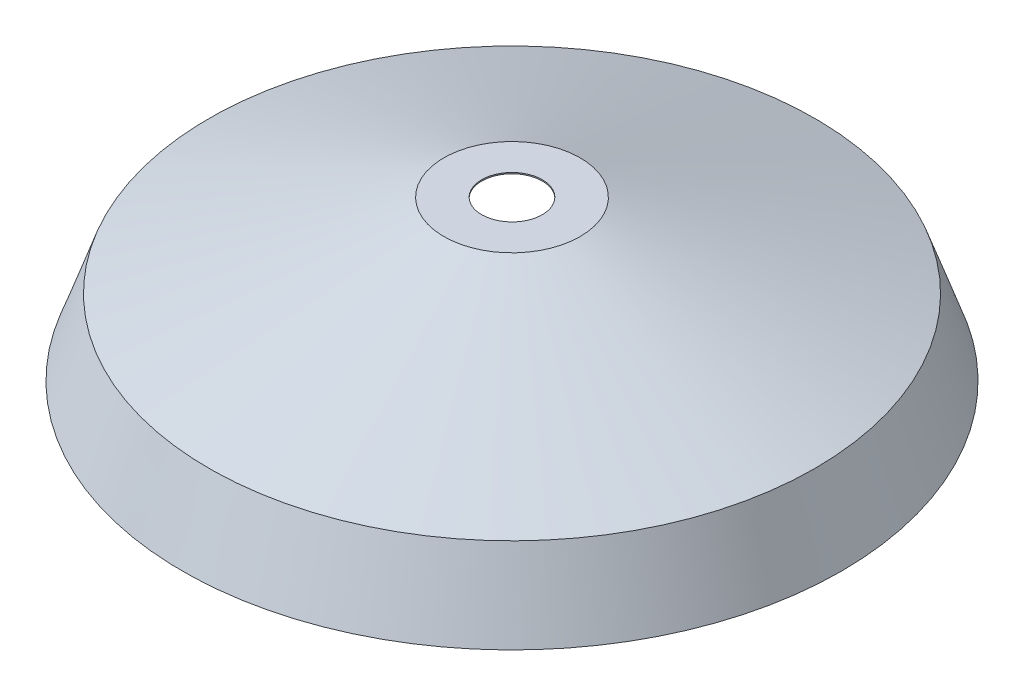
from build123d import *

# Parameters (mm, degrees)
CROQUIS2_R            = 20
CORTAR_EXTRUIR1_DEPTH = 10


with BuildPart() as part:
    # Croquis1 → Revoluci_n1 (revolve)
    with BuildSketch(Plane.XY):
        Polygon((217.5, -52.5), (200, -2.5), (45, 52.5), (0, 52.5), (0, 51.7), (44.862271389, 51.7), (199.37145953, -3.125840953), (216.652415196, -52.5), align=None)
    revolve(axis=Axis((0, 142.443010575, 0), (0, -1, 0)))

    # Croquis2 → Cortar-Extruir1 (cut)
    with BuildSketch(Plane(origin=(0, 52.5, 0), x_dir=(1, 0, 0), z_dir=(0, 1, 0))):
        with Locations(Location((0, 0, 0), (0, 0, 180))):
            Circle(CROQUIS2_R)
    extrude(amount=-CORTAR_EXTRUIR1_DEPTH, mode=Mode.SUBTRACT)


solid = part.part
